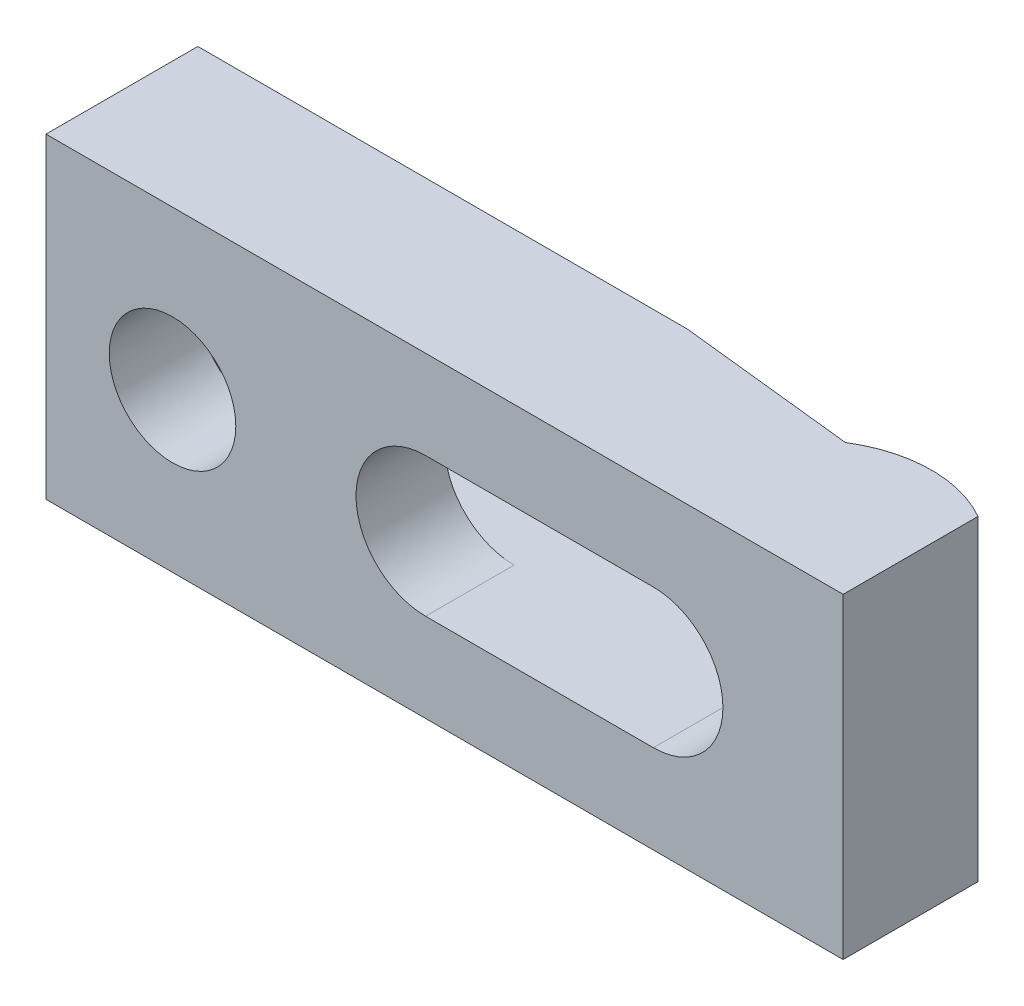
ISO-10303-21;
HEADER;
FILE_DESCRIPTION(('STEP AP214'),'2;1');
FILE_NAME('part.step','',(''),(''),'','','');
FILE_SCHEMA(('AUTOMOTIVE_DESIGN { 1 0 10303 214 1 1 1 1 }'));
ENDSEC;
DATA;
#1=APPLICATION_CONTEXT('core data for automotive mechanical design processes');
#2=APPLICATION_PROTOCOL_DEFINITION('international standard','automotive_design',2000,#1);
#3=PRODUCT_CONTEXT('',#1,'mechanical');
#4=PRODUCT('Part','Part','',(#3));
#5=PRODUCT_RELATED_PRODUCT_CATEGORY('part','',(#4));
#6=PRODUCT_DEFINITION_FORMATION('','',#4);
#7=PRODUCT_DEFINITION_CONTEXT('part definition',#1,'design');
#8=PRODUCT_DEFINITION('design','',#6,#7);
#9=PRODUCT_DEFINITION_SHAPE('','',#8);
#10=(LENGTH_UNIT() NAMED_UNIT(*) SI_UNIT(.MILLI.,.METRE.));
#11=(NAMED_UNIT(*) PLANE_ANGLE_UNIT() SI_UNIT($,.RADIAN.));
#12=(NAMED_UNIT(*) SI_UNIT($,.STERADIAN.) SOLID_ANGLE_UNIT());
#13=UNCERTAINTY_MEASURE_WITH_UNIT(LENGTH_MEASURE(1.E-05),#10,'distance_accuracy_value','');
#14=(GEOMETRIC_REPRESENTATION_CONTEXT(3) GLOBAL_UNCERTAINTY_ASSIGNED_CONTEXT((#13)) GLOBAL_UNIT_ASSIGNED_CONTEXT((#10,
#11,#12)) REPRESENTATION_CONTEXT('',''));
#15=CARTESIAN_POINT('',(0.,0.,0.));
#16=DIRECTION('',(0.,0.,1.));
#17=DIRECTION('',(1.,0.,0.));
#18=AXIS2_PLACEMENT_3D('',#15,#16,#17);
#19=CARTESIAN_POINT('',(-48.,12.5,0.));
#20=DIRECTION('',(0.,0.,-1.));
#21=DIRECTION('',(-1.,0.,0.));
#22=AXIS2_PLACEMENT_3D('',#19,#20,#21);
#23=PLANE('',#22);
#24=DIRECTION('',(1.,0.,0.));
#25=VECTOR('',#24,1.);
#26=CARTESIAN_POINT('',(-18.,5.5,0.));
#27=LINE('',#26,#25);
#28=CARTESIAN_POINT('',(-48.,5.5,0.));
#29=VERTEX_POINT('',#28);
#30=CARTESIAN_POINT('',(-9.3,5.5,0.));
#31=VERTEX_POINT('',#30);
#32=EDGE_CURVE('E127',#29,#31,#27,.T.);
#33=ORIENTED_EDGE('',*,*,#32,.F.);
#34=DIRECTION('',(0.,-1.,0.));
#35=VECTOR('',#34,1.);
#36=CARTESIAN_POINT('',(-48.,12.5,0.));
#37=LINE('',#36,#35);
#38=CARTESIAN_POINT('',(-48.,12.5,0.));
#39=VERTEX_POINT('',#38);
#40=EDGE_CURVE('E144',#39,#29,#37,.T.);
#41=ORIENTED_EDGE('',*,*,#40,.F.);
#42=DIRECTION('',(1.,0.,0.));
#43=VECTOR('',#42,1.);
#44=CARTESIAN_POINT('',(-48.,12.5,0.));
#45=LINE('',#44,#43);
#46=CARTESIAN_POINT('',(-9.3,12.5,0.));
#47=VERTEX_POINT('',#46);
#48=EDGE_CURVE('E262',#39,#47,#45,.T.);
#49=ORIENTED_EDGE('',*,*,#48,.T.);
#50=DIRECTION('',(0.,-1.,0.));
#51=VECTOR('',#50,1.);
#52=CARTESIAN_POINT('',(-9.3,12.5,0.));
#53=LINE('',#52,#51);
#54=EDGE_CURVE('E152',#47,#31,#53,.T.);
#55=ORIENTED_EDGE('',*,*,#54,.T.);
#56=EDGE_LOOP('',(#33,#41,#49,#55));
#57=FACE_BOUND('',#56,.T.);
#58=ADVANCED_FACE('F14',(#57),#23,.T.);
#59=CARTESIAN_POINT('',(-48.,12.5,12.));
#60=DIRECTION('',(-1.,0.,0.));
#61=DIRECTION('',(0.,0.,1.));
#62=AXIS2_PLACEMENT_3D('',#59,#60,#61);
#63=PLANE('',#62);
#64=ORIENTED_EDGE('',*,*,#40,.T.);
#65=DIRECTION('',(0.,0.,1.));
#66=VECTOR('',#65,1.);
#67=CARTESIAN_POINT('',(-48.,5.5,12.));
#68=LINE('',#67,#66);
#69=CARTESIAN_POINT('',(-48.,5.5,5.));
#70=VERTEX_POINT('',#69);
#71=EDGE_CURVE('E138',#29,#70,#68,.T.);
#72=ORIENTED_EDGE('',*,*,#71,.T.);
#73=DIRECTION('',(0.,-1.,0.));
#74=VECTOR('',#73,1.);
#75=CARTESIAN_POINT('',(-48.,12.5,5.));
#76=LINE('',#75,#74);
#77=CARTESIAN_POINT('',(-48.,-5.5,5.));
#78=VERTEX_POINT('',#77);
#79=EDGE_CURVE('E137',#70,#78,#76,.T.);
#80=ORIENTED_EDGE('',*,*,#79,.T.);
#81=DIRECTION('',(0.,0.,1.));
#82=VECTOR('',#81,1.);
#83=CARTESIAN_POINT('',(-48.,-5.5,12.));
#84=LINE('',#83,#82);
#85=CARTESIAN_POINT('',(-48.,-5.5,0.));
#86=VERTEX_POINT('',#85);
#87=EDGE_CURVE('E120',#86,#78,#84,.T.);
#88=ORIENTED_EDGE('',*,*,#87,.F.);
#89=CARTESIAN_POINT('',(-48.,-12.5,0.));
#90=VERTEX_POINT('',#89);
#91=EDGE_CURVE('E134',#86,#90,#37,.T.);
#92=ORIENTED_EDGE('',*,*,#91,.T.);
#93=DIRECTION('',(0.,0.,-1.));
#94=VECTOR('',#93,1.);
#95=CARTESIAN_POINT('',(-48.,-12.5,12.));
#96=LINE('',#95,#94);
#97=CARTESIAN_POINT('',(-48.,-12.5,12.));
#98=VERTEX_POINT('',#97);
#99=EDGE_CURVE('E285',#98,#90,#96,.T.);
#100=ORIENTED_EDGE('',*,*,#99,.F.);
#101=DIRECTION('',(0.,-1.,0.));
#102=VECTOR('',#101,1.);
#103=CARTESIAN_POINT('',(-48.,12.5,12.));
#104=LINE('',#103,#102);
#105=CARTESIAN_POINT('',(-48.,12.5,12.));
#106=VERTEX_POINT('',#105);
#107=EDGE_CURVE('E145',#106,#98,#104,.T.);
#108=ORIENTED_EDGE('',*,*,#107,.F.);
#109=DIRECTION('',(0.,0.,-1.));
#110=VECTOR('',#109,1.);
#111=CARTESIAN_POINT('',(-48.,12.5,12.));
#112=LINE('',#111,#110);
#113=EDGE_CURVE('E258',#106,#39,#112,.T.);
#114=ORIENTED_EDGE('',*,*,#113,.T.);
#115=EDGE_LOOP('',(#64,#72,#80,#88,#92,#100,#108,#114));
#116=FACE_BOUND('',#115,.T.);
#117=ADVANCED_FACE('F132',(#116),#63,.T.);
#118=CARTESIAN_POINT('',(-18.,0.,12.));
#119=DIRECTION('',(0.,0.,-1.));
#120=DIRECTION('',(-1.,0.,0.));
#121=AXIS2_PLACEMENT_3D('',#118,#119,#120);
#122=CYLINDRICAL_SURFACE('',#121,5.5);
#123=DIRECTION('',(0.,0.,-1.));
#124=VECTOR('',#123,1.);
#125=CARTESIAN_POINT('',(-18.,-5.5,12.));
#126=LINE('',#125,#124);
#127=CARTESIAN_POINT('',(-18.,-5.5,12.));
#128=VERTEX_POINT('',#127);
#129=CARTESIAN_POINT('',(-18.,-5.5,5.));
#130=VERTEX_POINT('',#129);
#131=EDGE_CURVE('E176',#128,#130,#126,.T.);
#132=ORIENTED_EDGE('',*,*,#131,.T.);
#133=CARTESIAN_POINT('',(-18.,0.,5.));
#134=DIRECTION('',(0.,0.,-1.));
#135=DIRECTION('',(-1.,0.,0.));
#136=AXIS2_PLACEMENT_3D('',#133,#134,#135);
#137=CIRCLE('',#136,5.5);
#138=CARTESIAN_POINT('',(-18.,5.5,5.));
#139=VERTEX_POINT('',#138);
#140=EDGE_CURVE('E300',#130,#139,#137,.T.);
#141=ORIENTED_EDGE('',*,*,#140,.T.);
#142=DIRECTION('',(0.,0.,-1.));
#143=VECTOR('',#142,1.);
#144=CARTESIAN_POINT('',(-18.,5.5,12.));
#145=LINE('',#144,#143);
#146=CARTESIAN_POINT('',(-18.,5.5,12.));
#147=VERTEX_POINT('',#146);
#148=EDGE_CURVE('E178',#147,#139,#145,.T.);
#149=ORIENTED_EDGE('',*,*,#148,.F.);
#150=CARTESIAN_POINT('',(-18.,0.,12.));
#151=DIRECTION('',(0.,0.,1.));
#152=DIRECTION('',(1.,0.,0.));
#153=AXIS2_PLACEMENT_3D('',#150,#151,#152);
#154=CIRCLE('',#153,5.5);
#155=EDGE_CURVE('E38',#147,#128,#154,.T.);
#156=ORIENTED_EDGE('',*,*,#155,.T.);
#157=EDGE_LOOP('',(#132,#141,#149,#156));
#158=FACE_BOUND('',#157,.T.);
#159=ADVANCED_FACE('F215',(#158),#122,.F.);
#160=CARTESIAN_POINT('',(-38.,0.,12.));
#161=DIRECTION('',(0.,0.,-1.));
#162=DIRECTION('',(-1.,0.,0.));
#163=AXIS2_PLACEMENT_3D('',#160,#161,#162);
#164=CYLINDRICAL_SURFACE('',#163,5.);
#165=CARTESIAN_POINT('',(-38.,0.,12.));
#166=DIRECTION('',(0.,0.,1.));
#167=DIRECTION('',(1.,0.,0.));
#168=AXIS2_PLACEMENT_3D('',#165,#166,#167);
#169=CIRCLE('',#168,5.);
#170=CARTESIAN_POINT('',(-33.,0.,12.));
#171=VERTEX_POINT('',#170);
#172=EDGE_CURVE('E254',#171,#171,#169,.T.);
#173=ORIENTED_EDGE('',*,*,#172,.T.);
#174=EDGE_LOOP('',(#173));
#175=FACE_BOUND('',#174,.T.);
#176=CARTESIAN_POINT('',(-38.,0.,5.));
#177=DIRECTION('',(0.,0.,-1.));
#178=DIRECTION('',(-1.,0.,0.));
#179=AXIS2_PLACEMENT_3D('',#176,#177,#178);
#180=CIRCLE('',#179,5.);
#181=CARTESIAN_POINT('',(-43.,0.,5.));
#182=VERTEX_POINT('',#181);
#183=EDGE_CURVE('E18',#182,#182,#180,.T.);
#184=ORIENTED_EDGE('',*,*,#183,.T.);
#185=EDGE_LOOP('',(#184));
#186=FACE_BOUND('',#185,.T.);
#187=ADVANCED_FACE('F210',(#175,#186),#164,.F.);
#188=CARTESIAN_POINT('',(15.,12.5,12.));
#189=DIRECTION('',(0.,0.,1.));
#190=DIRECTION('',(1.,0.,0.));
#191=AXIS2_PLACEMENT_3D('',#188,#189,#190);
#192=PLANE('',#191);
#193=DIRECTION('',(1.,0.,0.));
#194=VECTOR('',#193,1.);
#195=CARTESIAN_POINT('',(-18.,5.5,12.));
#196=LINE('',#195,#194);
#197=CARTESIAN_POINT('',(0.,5.5,12.));
#198=VERTEX_POINT('',#197);
#199=EDGE_CURVE('E294',#147,#198,#196,.T.);
#200=ORIENTED_EDGE('',*,*,#199,.T.);
#201=CARTESIAN_POINT('',(0.,0.,12.));
#202=DIRECTION('',(0.,0.,1.));
#203=DIRECTION('',(1.,0.,0.));
#204=AXIS2_PLACEMENT_3D('',#201,#202,#203);
#205=CIRCLE('',#204,5.5);
#206=CARTESIAN_POINT('',(0.,-5.5,12.));
#207=VERTEX_POINT('',#206);
#208=EDGE_CURVE('E126',#207,#198,#205,.T.);
#209=ORIENTED_EDGE('',*,*,#208,.F.);
#210=DIRECTION('',(-1.,0.,0.));
#211=VECTOR('',#210,1.);
#212=CARTESIAN_POINT('',(0.,-5.5,12.));
#213=LINE('',#212,#211);
#214=EDGE_CURVE('E174',#207,#128,#213,.T.);
#215=ORIENTED_EDGE('',*,*,#214,.T.);
#216=ORIENTED_EDGE('',*,*,#155,.F.);
#217=EDGE_LOOP('',(#200,#209,#215,#216));
#218=FACE_BOUND('',#217,.T.);
#219=DIRECTION('',(0.,-1.,0.));
#220=VECTOR('',#219,1.);
#221=CARTESIAN_POINT('',(15.,12.5,12.));
#222=LINE('',#221,#220);
#223=CARTESIAN_POINT('',(15.,12.5,12.));
#224=VERTEX_POINT('',#223);
#225=CARTESIAN_POINT('',(15.,-12.5,12.));
#226=VERTEX_POINT('',#225);
#227=EDGE_CURVE('E161',#224,#226,#222,.T.);
#228=ORIENTED_EDGE('',*,*,#227,.F.);
#229=DIRECTION('',(-1.,0.,0.));
#230=VECTOR('',#229,1.);
#231=CARTESIAN_POINT('',(15.,12.5,12.));
#232=LINE('',#231,#230);
#233=EDGE_CURVE('E263',#224,#106,#232,.T.);
#234=ORIENTED_EDGE('',*,*,#233,.T.);
#235=ORIENTED_EDGE('',*,*,#107,.T.);
#236=DIRECTION('',(-1.,0.,0.));
#237=VECTOR('',#236,1.);
#238=CARTESIAN_POINT('',(15.,-12.5,12.));
#239=LINE('',#238,#237);
#240=EDGE_CURVE('E198',#226,#98,#239,.T.);
#241=ORIENTED_EDGE('',*,*,#240,.F.);
#242=EDGE_LOOP('',(#228,#234,#235,#241));
#243=FACE_BOUND('',#242,.T.);
#244=ORIENTED_EDGE('',*,*,#172,.F.);
#245=EDGE_LOOP('',(#244));
#246=FACE_BOUND('',#245,.T.);
#247=ADVANCED_FACE('F228',(#218,#243,#246),#192,.T.);
#248=ORIENTED_EDGE('',*,*,#91,.F.);
#249=DIRECTION('',(-1.,0.,0.));
#250=VECTOR('',#249,1.);
#251=CARTESIAN_POINT('',(0.,-5.5,0.));
#252=LINE('',#251,#250);
#253=CARTESIAN_POINT('',(-9.3,-5.5,0.));
#254=VERTEX_POINT('',#253);
#255=EDGE_CURVE('E115',#254,#86,#252,.T.);
#256=ORIENTED_EDGE('',*,*,#255,.F.);
#257=CARTESIAN_POINT('',(-9.3,-12.5,0.));
#258=VERTEX_POINT('',#257);
#259=EDGE_CURVE('E147',#254,#258,#53,.T.);
#260=ORIENTED_EDGE('',*,*,#259,.T.);
#261=DIRECTION('',(1.,0.,0.));
#262=VECTOR('',#261,1.);
#263=CARTESIAN_POINT('',(-48.,-12.5,0.));
#264=LINE('',#263,#262);
#265=EDGE_CURVE('E143',#90,#258,#264,.T.);
#266=ORIENTED_EDGE('',*,*,#265,.F.);
#267=EDGE_LOOP('',(#248,#256,#260,#266));
#268=FACE_BOUND('',#267,.T.);
#269=ADVANCED_FACE('F141',(#268),#23,.T.);
#270=CARTESIAN_POINT('',(10.,12.5,10.));
#271=DIRECTION('',(0.,-1.,0.));
#272=DIRECTION('',(0.,0.,-1.));
#273=AXIS2_PLACEMENT_3D('',#270,#271,#272);
#274=CYLINDRICAL_SURFACE('',#273,10.);
#275=CARTESIAN_POINT('',(4.49084420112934,3.1752666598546,1.65439023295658));
#276=CARTESIAN_POINT('',(4.56984809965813,3.06359534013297,1.60224264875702));
#277=CARTESIAN_POINT('',(4.64546895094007,2.94773997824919,1.55392976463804));
#278=CARTESIAN_POINT('',(4.78884780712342,2.70855450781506,1.46471759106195));
#279=CARTESIAN_POINT('',(4.85660597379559,2.58522455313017,1.42381814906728));
#280=CARTESIAN_POINT('',(4.98308144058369,2.33214786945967,1.34922483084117));
#281=CARTESIAN_POINT('',(5.04181070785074,2.2024099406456,1.31552139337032));
#282=CARTESIAN_POINT('',(5.14945828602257,1.93740120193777,1.25494057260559));
#283=CARTESIAN_POINT('',(5.19837748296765,1.80213089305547,1.22806257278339));
#284=CARTESIAN_POINT('',(5.28309654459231,1.53534952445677,1.18223384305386));
#285=CARTESIAN_POINT('',(5.31950515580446,1.40409594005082,1.1629057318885));
#286=CARTESIAN_POINT('',(5.38259832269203,1.13853677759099,1.1297759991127));
#287=CARTESIAN_POINT('',(5.4092794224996,1.00423013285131,1.11597634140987));
#288=CARTESIAN_POINT('',(5.45256455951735,0.733683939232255,1.09374247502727));
#289=CARTESIAN_POINT('',(5.46917715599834,0.597446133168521,1.08530370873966));
#290=CARTESIAN_POINT('',(5.49217577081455,0.323825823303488,1.07365206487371));
#291=CARTESIAN_POINT('',(5.49855713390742,0.186442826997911,1.07044156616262));
#292=CARTESIAN_POINT('',(5.50100923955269,-0.0887714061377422,1.06920584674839));
#293=CARTESIAN_POINT('',(5.49705497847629,-0.226602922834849,1.07119320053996));
#294=CARTESIAN_POINT('',(5.47883194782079,-0.501343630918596,1.08040678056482));
#295=CARTESIAN_POINT('',(5.46456785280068,-0.638253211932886,1.08763063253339));
#296=CARTESIAN_POINT('',(5.42587847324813,-0.910352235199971,1.10742533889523));
#297=CARTESIAN_POINT('',(5.40144496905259,-1.04554019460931,1.12000051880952));
#298=CARTESIAN_POINT('',(5.34271514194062,-1.3130660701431,1.15066142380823));
#299=CARTESIAN_POINT('',(5.30842257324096,-1.44540505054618,1.16874505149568));
#300=CARTESIAN_POINT('',(5.23037882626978,-1.70636668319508,1.21064993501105));
#301=CARTESIAN_POINT('',(5.18662550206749,-1.83498848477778,1.23447249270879));
#302=CARTESIAN_POINT('',(5.09021998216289,-2.0875676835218,1.28810589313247));
#303=CARTESIAN_POINT('',(5.03756762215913,-2.21152499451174,1.3179168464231));
#304=CARTESIAN_POINT('',(4.92401628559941,-2.45397026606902,1.38381149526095));
#305=CARTESIAN_POINT('',(4.86311213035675,-2.57245472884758,1.41989913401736));
#306=CARTESIAN_POINT('',(4.73394184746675,-2.80309686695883,1.49856949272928));
#307=CARTESIAN_POINT('',(4.66567519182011,-2.91525408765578,1.54115267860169));
#308=CARTESIAN_POINT('',(4.59416135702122,-3.0238520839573,1.58709868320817));
#309=B_SPLINE_CURVE_WITH_KNOTS('',3,(#275,#276,#277,#278,#279,#280,#281,#282,#283,#284,#285,
#286,#287,#288,#289,#290,#291,#292,#293,#294,#295,#296,#297,#298,#299,#300,#301,#302,#303,#304,
#305,#306,#307,#308),.UNSPECIFIED.,.F.,.F.,(4,2,2,2,2,2,2,2,2,2,2,2,2,2,2,2,4),(0.,
0.439039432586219,0.878069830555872,1.31651321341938,1.75491697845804,2.16715557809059,
2.57954049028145,2.99157433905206,3.4037956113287,3.81701503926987,4.23004722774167,
4.64341390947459,5.05662339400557,5.46992670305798,5.88323764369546,6.29680918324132,
6.71041040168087),.UNSPECIFIED.);
#310=CARTESIAN_POINT('',(4.7,2.85657137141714,1.52002358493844));
#311=VERTEX_POINT('',#310);
#312=CARTESIAN_POINT('',(4.7,-2.85657137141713,1.52002358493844));
#313=VERTEX_POINT('',#312);
#314=EDGE_CURVE('E170',#311,#313,#309,.T.);
#315=ORIENTED_EDGE('',*,*,#314,.F.);
#316=DIRECTION('',(0.,-1.,0.));
#317=VECTOR('',#316,1.);
#318=CARTESIAN_POINT('',(4.7,12.5,1.52002358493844));
#319=LINE('',#318,#317);
#320=CARTESIAN_POINT('',(4.7,12.5,1.52002358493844));
#321=VERTEX_POINT('',#320);
#322=EDGE_CURVE('E156',#321,#311,#319,.T.);
#323=ORIENTED_EDGE('',*,*,#322,.F.);
#324=CARTESIAN_POINT('',(10.,12.5,10.));
#325=DIRECTION('',(0.,1.,0.));
#326=DIRECTION('',(0.,0.,1.));
#327=AXIS2_PLACEMENT_3D('',#324,#325,#326);
#328=CIRCLE('',#327,10.);
#329=CARTESIAN_POINT('',(15.,12.5,1.33974596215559));
#330=VERTEX_POINT('',#329);
#331=EDGE_CURVE('E270',#330,#321,#328,.T.);
#332=ORIENTED_EDGE('',*,*,#331,.F.);
#333=DIRECTION('',(0.,-1.,0.));
#334=VECTOR('',#333,1.);
#335=CARTESIAN_POINT('',(15.,12.5,1.33974596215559));
#336=LINE('',#335,#334);
#337=CARTESIAN_POINT('',(15.,-12.5,1.33974596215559));
#338=VERTEX_POINT('',#337);
#339=EDGE_CURVE('E159',#330,#338,#336,.T.);
#340=ORIENTED_EDGE('',*,*,#339,.T.);
#341=CARTESIAN_POINT('',(10.,-12.5,10.));
#342=DIRECTION('',(0.,1.,0.));
#343=DIRECTION('',(0.,0.,1.));
#344=AXIS2_PLACEMENT_3D('',#341,#342,#343);
#345=CIRCLE('',#344,10.);
#346=CARTESIAN_POINT('',(4.7,-12.5,1.52002358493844));
#347=VERTEX_POINT('',#346);
#348=EDGE_CURVE('E275',#338,#347,#345,.T.);
#349=ORIENTED_EDGE('',*,*,#348,.T.);
#350=EDGE_CURVE('E155',#313,#347,#319,.T.);
#351=ORIENTED_EDGE('',*,*,#350,.F.);
#352=EDGE_LOOP('',(#315,#323,#332,#340,#349,#351));
#353=FACE_BOUND('',#352,.T.);
#354=ADVANCED_FACE('F201',(#353),#274,.T.);
#355=CARTESIAN_POINT('',(4.7,12.5,1.52002358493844));
#356=DIRECTION('',(-0.107938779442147,0.,0.994157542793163));
#357=DIRECTION('',(0.994157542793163,0.,0.107938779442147));
#358=AXIS2_PLACEMENT_3D('',#355,#356,#357);
#359=PLANE('',#358);
#360=CARTESIAN_POINT('',(0.,0.,1.00972995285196));
#361=DIRECTION('',(-0.107938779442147,0.,0.994157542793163));
#362=DIRECTION('',(-0.994157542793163,0.,-0.107938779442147));
#363=AXIS2_PLACEMENT_3D('',#360,#361,#362);
#364=ELLIPSE('',#363,5.532322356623,5.5);
#365=CARTESIAN_POINT('',(0.,5.5,1.00972995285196));
#366=VERTEX_POINT('',#365);
#367=EDGE_CURVE('E9',#366,#311,#364,.F.);
#368=ORIENTED_EDGE('',*,*,#367,.F.);
#369=DIRECTION('',(-0.994157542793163,0.,-0.107938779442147));
#370=VECTOR('',#369,1.);
#371=CARTESIAN_POINT('',(4.7,5.5,1.52002358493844));
#372=LINE('',#371,#370);
#373=EDGE_CURVE('E190',#366,#31,#372,.T.);
#374=ORIENTED_EDGE('',*,*,#373,.T.);
#375=ORIENTED_EDGE('',*,*,#54,.F.);
#376=DIRECTION('',(-0.994157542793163,0.,-0.107938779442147));
#377=VECTOR('',#376,1.);
#378=CARTESIAN_POINT('',(4.7,12.5,1.52002358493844));
#379=LINE('',#378,#377);
#380=EDGE_CURVE('E268',#321,#47,#379,.T.);
#381=ORIENTED_EDGE('',*,*,#380,.F.);
#382=ORIENTED_EDGE('',*,*,#322,.T.);
#383=EDGE_LOOP('',(#368,#374,#375,#381,#382));
#384=FACE_BOUND('',#383,.T.);
#385=ADVANCED_FACE('F235',(#384),#359,.F.);
#386=CARTESIAN_POINT('',(0.,-5.5,1.00972995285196));
#387=VERTEX_POINT('',#386);
#388=EDGE_CURVE('E23',#313,#387,#364,.F.);
#389=ORIENTED_EDGE('',*,*,#388,.F.);
#390=ORIENTED_EDGE('',*,*,#350,.T.);
#391=DIRECTION('',(-0.994157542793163,0.,-0.107938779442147));
#392=VECTOR('',#391,1.);
#393=CARTESIAN_POINT('',(4.7,-12.5,1.52002358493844));
#394=LINE('',#393,#392);
#395=EDGE_CURVE('E279',#347,#258,#394,.T.);
#396=ORIENTED_EDGE('',*,*,#395,.T.);
#397=ORIENTED_EDGE('',*,*,#259,.F.);
#398=DIRECTION('',(0.994157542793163,0.,0.107938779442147));
#399=VECTOR('',#398,1.);
#400=CARTESIAN_POINT('',(4.7,-5.5,1.52002358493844));
#401=LINE('',#400,#399);
#402=EDGE_CURVE('E122',#254,#387,#401,.T.);
#403=ORIENTED_EDGE('',*,*,#402,.T.);
#404=EDGE_LOOP('',(#389,#390,#396,#397,#403));
#405=FACE_BOUND('',#404,.T.);
#406=ADVANCED_FACE('F237',(#405),#359,.F.);
#407=CARTESIAN_POINT('',(15.,12.5,12.));
#408=DIRECTION('',(-1.,0.,0.));
#409=DIRECTION('',(0.,0.,1.));
#410=AXIS2_PLACEMENT_3D('',#407,#408,#409);
#411=PLANE('',#410);
#412=ORIENTED_EDGE('',*,*,#339,.F.);
#413=DIRECTION('',(0.,0.,-1.));
#414=VECTOR('',#413,1.);
#415=CARTESIAN_POINT('',(15.,12.5,12.));
#416=LINE('',#415,#414);
#417=EDGE_CURVE('E148',#224,#330,#416,.T.);
#418=ORIENTED_EDGE('',*,*,#417,.F.);
#419=ORIENTED_EDGE('',*,*,#227,.T.);
#420=DIRECTION('',(0.,0.,-1.));
#421=VECTOR('',#420,1.);
#422=CARTESIAN_POINT('',(15.,-12.5,12.));
#423=LINE('',#422,#421);
#424=EDGE_CURVE('E199',#226,#338,#423,.T.);
#425=ORIENTED_EDGE('',*,*,#424,.T.);
#426=EDGE_LOOP('',(#412,#418,#419,#425));
#427=FACE_BOUND('',#426,.T.);
#428=ADVANCED_FACE('F16',(#427),#411,.F.);
#429=CARTESIAN_POINT('',(10.,12.5,10.));
#430=DIRECTION('',(0.,1.,0.));
#431=DIRECTION('',(0.,0.,1.));
#432=AXIS2_PLACEMENT_3D('',#429,#430,#431);
#433=PLANE('',#432);
#434=ORIENTED_EDGE('',*,*,#233,.F.);
#435=ORIENTED_EDGE('',*,*,#417,.T.);
#436=ORIENTED_EDGE('',*,*,#331,.T.);
#437=ORIENTED_EDGE('',*,*,#380,.T.);
#438=ORIENTED_EDGE('',*,*,#48,.F.);
#439=ORIENTED_EDGE('',*,*,#113,.F.);
#440=EDGE_LOOP('',(#434,#435,#436,#437,#438,#439));
#441=FACE_BOUND('',#440,.T.);
#442=ADVANCED_FACE('F223',(#441),#433,.T.);
#443=CARTESIAN_POINT('',(10.,-12.5,10.));
#444=DIRECTION('',(0.,1.,0.));
#445=DIRECTION('',(0.,0.,1.));
#446=AXIS2_PLACEMENT_3D('',#443,#444,#445);
#447=PLANE('',#446);
#448=ORIENTED_EDGE('',*,*,#240,.T.);
#449=ORIENTED_EDGE('',*,*,#99,.T.);
#450=ORIENTED_EDGE('',*,*,#265,.T.);
#451=ORIENTED_EDGE('',*,*,#395,.F.);
#452=ORIENTED_EDGE('',*,*,#348,.F.);
#453=ORIENTED_EDGE('',*,*,#424,.F.);
#454=EDGE_LOOP('',(#448,#449,#450,#451,#452,#453));
#455=FACE_BOUND('',#454,.T.);
#456=ADVANCED_FACE('F209',(#455),#447,.F.);
#457=CARTESIAN_POINT('',(0.,0.,12.));
#458=DIRECTION('',(0.,0.,-1.));
#459=DIRECTION('',(-1.,0.,0.));
#460=AXIS2_PLACEMENT_3D('',#457,#458,#459);
#461=CYLINDRICAL_SURFACE('',#460,5.5);
#462=ORIENTED_EDGE('',*,*,#367,.T.);
#463=ORIENTED_EDGE('',*,*,#314,.T.);
#464=ORIENTED_EDGE('',*,*,#388,.T.);
#465=DIRECTION('',(0.,0.,-1.));
#466=VECTOR('',#465,1.);
#467=CARTESIAN_POINT('',(0.,-5.5,12.));
#468=LINE('',#467,#466);
#469=EDGE_CURVE('E167',#207,#387,#468,.T.);
#470=ORIENTED_EDGE('',*,*,#469,.F.);
#471=ORIENTED_EDGE('',*,*,#208,.T.);
#472=DIRECTION('',(0.,0.,-1.));
#473=VECTOR('',#472,1.);
#474=CARTESIAN_POINT('',(0.,5.5,12.));
#475=LINE('',#474,#473);
#476=EDGE_CURVE('E186',#198,#366,#475,.T.);
#477=ORIENTED_EDGE('',*,*,#476,.T.);
#478=EDGE_LOOP('',(#462,#463,#464,#470,#471,#477));
#479=FACE_BOUND('',#478,.T.);
#480=ADVANCED_FACE('F165',(#479),#461,.F.);
#481=CARTESIAN_POINT('',(-18.,5.5,12.));
#482=DIRECTION('',(0.,1.,0.));
#483=DIRECTION('',(0.,0.,1.));
#484=AXIS2_PLACEMENT_3D('',#481,#482,#483);
#485=PLANE('',#484);
#486=ORIENTED_EDGE('',*,*,#32,.T.);
#487=ORIENTED_EDGE('',*,*,#373,.F.);
#488=ORIENTED_EDGE('',*,*,#476,.F.);
#489=ORIENTED_EDGE('',*,*,#199,.F.);
#490=ORIENTED_EDGE('',*,*,#148,.T.);
#491=DIRECTION('',(-1.,0.,0.));
#492=VECTOR('',#491,1.);
#493=CARTESIAN_POINT('',(-5.,5.5,5.));
#494=LINE('',#493,#492);
#495=EDGE_CURVE('E30',#139,#70,#494,.T.);
#496=ORIENTED_EDGE('',*,*,#495,.T.);
#497=ORIENTED_EDGE('',*,*,#71,.F.);
#498=EDGE_LOOP('',(#486,#487,#488,#489,#490,#496,#497));
#499=FACE_BOUND('',#498,.T.);
#500=ADVANCED_FACE('F208',(#499),#485,.F.);
#501=CARTESIAN_POINT('',(0.,-5.5,12.));
#502=DIRECTION('',(0.,-1.,0.));
#503=DIRECTION('',(1.,0.,0.));
#504=AXIS2_PLACEMENT_3D('',#501,#502,#503);
#505=PLANE('',#504);
#506=ORIENTED_EDGE('',*,*,#469,.T.);
#507=ORIENTED_EDGE('',*,*,#402,.F.);
#508=ORIENTED_EDGE('',*,*,#255,.T.);
#509=ORIENTED_EDGE('',*,*,#87,.T.);
#510=DIRECTION('',(-1.,0.,0.));
#511=VECTOR('',#510,1.);
#512=CARTESIAN_POINT('',(-5.,-5.5,5.));
#513=LINE('',#512,#511);
#514=EDGE_CURVE('E302',#130,#78,#513,.T.);
#515=ORIENTED_EDGE('',*,*,#514,.F.);
#516=ORIENTED_EDGE('',*,*,#131,.F.);
#517=ORIENTED_EDGE('',*,*,#214,.F.);
#518=EDGE_LOOP('',(#506,#507,#508,#509,#515,#516,#517));
#519=FACE_BOUND('',#518,.T.);
#520=ADVANCED_FACE('F118',(#519),#505,.F.);
#521=CARTESIAN_POINT('',(-5.,-5.5,5.));
#522=DIRECTION('',(0.,0.,-1.));
#523=DIRECTION('',(-1.,0.,0.));
#524=AXIS2_PLACEMENT_3D('',#521,#522,#523);
#525=PLANE('',#524);
#526=ORIENTED_EDGE('',*,*,#183,.F.);
#527=EDGE_LOOP('',(#526));
#528=FACE_BOUND('',#527,.T.);
#529=ORIENTED_EDGE('',*,*,#495,.F.);
#530=ORIENTED_EDGE('',*,*,#140,.F.);
#531=ORIENTED_EDGE('',*,*,#514,.T.);
#532=ORIENTED_EDGE('',*,*,#79,.F.);
#533=EDGE_LOOP('',(#529,#530,#531,#532));
#534=FACE_BOUND('',#533,.T.);
#535=ADVANCED_FACE('F214',(#528,#534),#525,.T.);
#536=CLOSED_SHELL('',(#58,#117,#159,#187,#247,#269,#354,#385,#406,#428,#442,#456,#480,#500,#520,#535));
#537=MANIFOLD_SOLID_BREP('B1',#536);
#538=ADVANCED_BREP_SHAPE_REPRESENTATION('',(#18,#537),#14);
#539=SHAPE_DEFINITION_REPRESENTATION(#9,#538);
ENDSEC;
END-ISO-10303-21;
